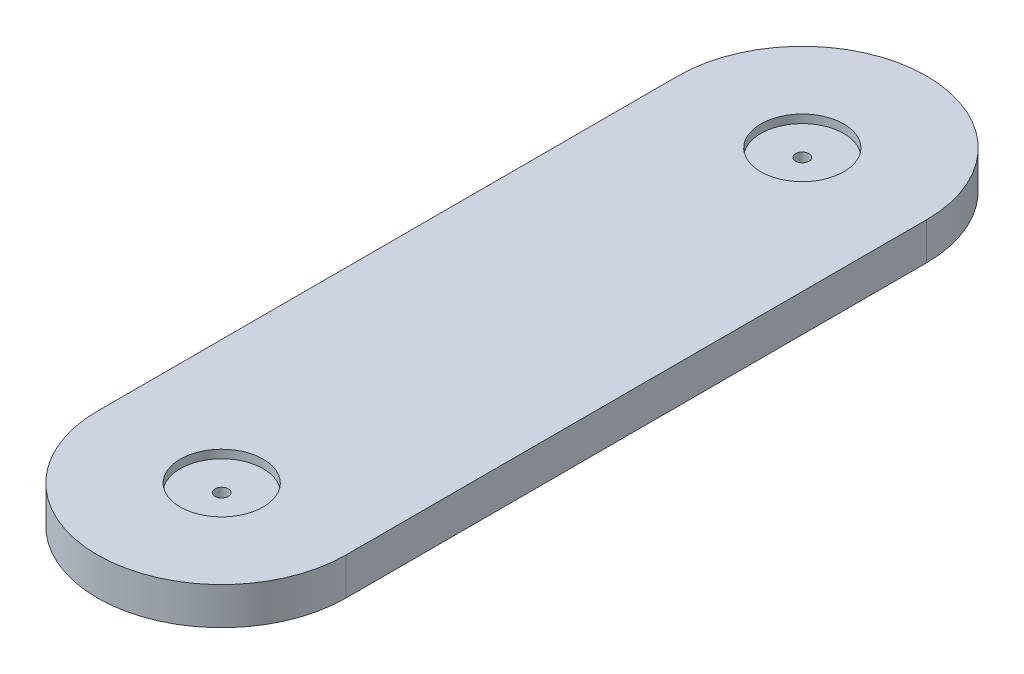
ISO-10303-21;
HEADER;
FILE_DESCRIPTION(('STEP AP214'),'2;1');
FILE_NAME('part.step','',(''),(''),'','','');
FILE_SCHEMA(('AUTOMOTIVE_DESIGN { 1 0 10303 214 1 1 1 1 }'));
ENDSEC;
DATA;
#1=APPLICATION_CONTEXT('core data for automotive mechanical design processes');
#2=APPLICATION_PROTOCOL_DEFINITION('international standard','automotive_design',2000,#1);
#3=PRODUCT_CONTEXT('',#1,'mechanical');
#4=PRODUCT('Part','Part','',(#3));
#5=PRODUCT_RELATED_PRODUCT_CATEGORY('part','',(#4));
#6=PRODUCT_DEFINITION_FORMATION('','',#4);
#7=PRODUCT_DEFINITION_CONTEXT('part definition',#1,'design');
#8=PRODUCT_DEFINITION('design','',#6,#7);
#9=PRODUCT_DEFINITION_SHAPE('','',#8);
#10=(LENGTH_UNIT() NAMED_UNIT(*) SI_UNIT(.MILLI.,.METRE.));
#11=(NAMED_UNIT(*) PLANE_ANGLE_UNIT() SI_UNIT($,.RADIAN.));
#12=(NAMED_UNIT(*) SI_UNIT($,.STERADIAN.) SOLID_ANGLE_UNIT());
#13=UNCERTAINTY_MEASURE_WITH_UNIT(LENGTH_MEASURE(1.E-05),#10,'distance_accuracy_value','');
#14=(GEOMETRIC_REPRESENTATION_CONTEXT(3) GLOBAL_UNCERTAINTY_ASSIGNED_CONTEXT((#13)) GLOBAL_UNIT_ASSIGNED_CONTEXT((#10,
#11,#12)) REPRESENTATION_CONTEXT('',''));
#15=CARTESIAN_POINT('',(0.,0.,0.));
#16=DIRECTION('',(0.,0.,1.));
#17=DIRECTION('',(1.,0.,0.));
#18=AXIS2_PLACEMENT_3D('',#15,#16,#17);
#19=CARTESIAN_POINT('',(-285.,0.,120.));
#20=DIRECTION('',(0.,-1.,0.));
#21=DIRECTION('',(0.,0.,-1.));
#22=AXIS2_PLACEMENT_3D('',#19,#20,#21);
#23=CYLINDRICAL_SURFACE('',#22,1.59999999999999);
#24=CARTESIAN_POINT('',(-285.,2.4,120.));
#25=DIRECTION('',(0.,-1.,0.));
#26=DIRECTION('',(0.,0.,-1.));
#27=AXIS2_PLACEMENT_3D('',#24,#25,#26);
#28=CIRCLE('',#27,1.59999999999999);
#29=CARTESIAN_POINT('',(-285.,2.4,118.4));
#30=VERTEX_POINT('',#29);
#31=EDGE_CURVE('E102',#30,#30,#28,.T.);
#32=ORIENTED_EDGE('',*,*,#31,.T.);
#33=EDGE_LOOP('',(#32));
#34=FACE_BOUND('',#33,.T.);
#35=CARTESIAN_POINT('',(-285.,7.,120.));
#36=DIRECTION('',(0.,1.,0.));
#37=DIRECTION('',(0.,0.,1.));
#38=AXIS2_PLACEMENT_3D('',#35,#36,#37);
#39=CIRCLE('',#38,1.59999999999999);
#40=CARTESIAN_POINT('',(-285.,7.,121.6));
#41=VERTEX_POINT('',#40);
#42=EDGE_CURVE('E36',#41,#41,#39,.F.);
#43=ORIENTED_EDGE('',*,*,#42,.F.);
#44=EDGE_LOOP('',(#43));
#45=FACE_BOUND('',#44,.T.);
#46=ADVANCED_FACE('F32',(#34,#45),#23,.F.);
#47=CARTESIAN_POINT('',(-285.,0.,-20.));
#48=DIRECTION('',(0.,-1.,0.));
#49=DIRECTION('',(0.,0.,-1.));
#50=AXIS2_PLACEMENT_3D('',#47,#48,#49);
#51=CYLINDRICAL_SURFACE('',#50,1.59999999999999);
#52=CARTESIAN_POINT('',(-285.,2.4,-20.));
#53=DIRECTION('',(0.,-1.,0.));
#54=DIRECTION('',(0.,0.,-1.));
#55=AXIS2_PLACEMENT_3D('',#52,#53,#54);
#56=CIRCLE('',#55,1.59999999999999);
#57=CARTESIAN_POINT('',(-285.,2.4,-21.6));
#58=VERTEX_POINT('',#57);
#59=EDGE_CURVE('E133',#58,#58,#56,.T.);
#60=ORIENTED_EDGE('',*,*,#59,.T.);
#61=EDGE_LOOP('',(#60));
#62=FACE_BOUND('',#61,.T.);
#63=CARTESIAN_POINT('',(-285.,7.,-20.));
#64=DIRECTION('',(0.,1.,0.));
#65=DIRECTION('',(0.,0.,1.));
#66=AXIS2_PLACEMENT_3D('',#63,#64,#65);
#67=CIRCLE('',#66,1.59999999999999);
#68=CARTESIAN_POINT('',(-285.,7.,-18.4));
#69=VERTEX_POINT('',#68);
#70=EDGE_CURVE('E107',#69,#69,#67,.F.);
#71=ORIENTED_EDGE('',*,*,#70,.F.);
#72=EDGE_LOOP('',(#71));
#73=FACE_BOUND('',#72,.T.);
#74=ADVANCED_FACE('F178',(#62,#73),#51,.F.);
#75=CARTESIAN_POINT('',(-285.,9.,-20.));
#76=DIRECTION('',(0.,-1.,0.));
#77=DIRECTION('',(0.,0.,-1.));
#78=AXIS2_PLACEMENT_3D('',#75,#76,#77);
#79=CYLINDRICAL_SURFACE('',#78,30.);
#80=CARTESIAN_POINT('',(-285.,0.,-20.));
#81=DIRECTION('',(0.,1.,0.));
#82=DIRECTION('',(0.,0.,1.));
#83=AXIS2_PLACEMENT_3D('',#80,#81,#82);
#84=CIRCLE('',#83,30.);
#85=CARTESIAN_POINT('',(-255.,0.,-20.));
#86=VERTEX_POINT('',#85);
#87=CARTESIAN_POINT('',(-315.,0.,-20.));
#88=VERTEX_POINT('',#87);
#89=EDGE_CURVE('E99',#86,#88,#84,.T.);
#90=ORIENTED_EDGE('',*,*,#89,.T.);
#91=DIRECTION('',(0.,-1.,0.));
#92=VECTOR('',#91,1.);
#93=CARTESIAN_POINT('',(-315.,9.,-20.));
#94=LINE('',#93,#92);
#95=CARTESIAN_POINT('',(-315.,9.,-20.));
#96=VERTEX_POINT('',#95);
#97=EDGE_CURVE('E11',#96,#88,#94,.T.);
#98=ORIENTED_EDGE('',*,*,#97,.F.);
#99=CARTESIAN_POINT('',(-285.,9.,-20.));
#100=DIRECTION('',(0.,1.,0.));
#101=DIRECTION('',(0.,0.,1.));
#102=AXIS2_PLACEMENT_3D('',#99,#100,#101);
#103=CIRCLE('',#102,30.);
#104=CARTESIAN_POINT('',(-255.,9.,-20.));
#105=VERTEX_POINT('',#104);
#106=EDGE_CURVE('E86',#105,#96,#103,.T.);
#107=ORIENTED_EDGE('',*,*,#106,.F.);
#108=DIRECTION('',(0.,-1.,0.));
#109=VECTOR('',#108,1.);
#110=CARTESIAN_POINT('',(-255.,9.,-20.));
#111=LINE('',#110,#109);
#112=EDGE_CURVE('E95',#105,#86,#111,.T.);
#113=ORIENTED_EDGE('',*,*,#112,.T.);
#114=EDGE_LOOP('',(#90,#98,#107,#113));
#115=FACE_BOUND('',#114,.T.);
#116=ADVANCED_FACE('F34',(#115),#79,.T.);
#117=CARTESIAN_POINT('',(-315.,9.,-20.));
#118=DIRECTION('',(1.,0.,0.));
#119=DIRECTION('',(0.,0.,-1.));
#120=AXIS2_PLACEMENT_3D('',#117,#118,#119);
#121=PLANE('',#120);
#122=DIRECTION('',(0.,0.,1.));
#123=VECTOR('',#122,1.);
#124=CARTESIAN_POINT('',(-315.,0.,-20.));
#125=LINE('',#124,#123);
#126=CARTESIAN_POINT('',(-315.,0.,120.));
#127=VERTEX_POINT('',#126);
#128=EDGE_CURVE('E90',#88,#127,#125,.T.);
#129=ORIENTED_EDGE('',*,*,#128,.T.);
#130=DIRECTION('',(0.,-1.,0.));
#131=VECTOR('',#130,1.);
#132=CARTESIAN_POINT('',(-315.,9.,120.));
#133=LINE('',#132,#131);
#134=CARTESIAN_POINT('',(-315.,9.,120.));
#135=VERTEX_POINT('',#134);
#136=EDGE_CURVE('E42',#135,#127,#133,.T.);
#137=ORIENTED_EDGE('',*,*,#136,.F.);
#138=DIRECTION('',(0.,0.,1.));
#139=VECTOR('',#138,1.);
#140=CARTESIAN_POINT('',(-315.,9.,-20.));
#141=LINE('',#140,#139);
#142=EDGE_CURVE('E81',#96,#135,#141,.T.);
#143=ORIENTED_EDGE('',*,*,#142,.F.);
#144=ORIENTED_EDGE('',*,*,#97,.T.);
#145=EDGE_LOOP('',(#129,#137,#143,#144));
#146=FACE_BOUND('',#145,.T.);
#147=ADVANCED_FACE('F89',(#146),#121,.F.);
#148=CARTESIAN_POINT('',(-285.,9.,120.));
#149=DIRECTION('',(0.,-1.,0.));
#150=DIRECTION('',(0.,0.,-1.));
#151=AXIS2_PLACEMENT_3D('',#148,#149,#150);
#152=CYLINDRICAL_SURFACE('',#151,29.9999999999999);
#153=CARTESIAN_POINT('',(-285.,0.,120.));
#154=DIRECTION('',(0.,1.,0.));
#155=DIRECTION('',(0.,0.,1.));
#156=AXIS2_PLACEMENT_3D('',#153,#154,#155);
#157=CIRCLE('',#156,29.9999999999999);
#158=CARTESIAN_POINT('',(-255.,0.,120.));
#159=VERTEX_POINT('',#158);
#160=EDGE_CURVE('E68',#127,#159,#157,.T.);
#161=ORIENTED_EDGE('',*,*,#160,.T.);
#162=DIRECTION('',(0.,-1.,0.));
#163=VECTOR('',#162,1.);
#164=CARTESIAN_POINT('',(-255.,9.,120.));
#165=LINE('',#164,#163);
#166=CARTESIAN_POINT('',(-255.,9.,120.));
#167=VERTEX_POINT('',#166);
#168=EDGE_CURVE('E91',#167,#159,#165,.T.);
#169=ORIENTED_EDGE('',*,*,#168,.F.);
#170=CARTESIAN_POINT('',(-285.,9.,120.));
#171=DIRECTION('',(0.,1.,0.));
#172=DIRECTION('',(0.,0.,1.));
#173=AXIS2_PLACEMENT_3D('',#170,#171,#172);
#174=CIRCLE('',#173,29.9999999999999);
#175=EDGE_CURVE('E84',#135,#167,#174,.T.);
#176=ORIENTED_EDGE('',*,*,#175,.F.);
#177=ORIENTED_EDGE('',*,*,#136,.T.);
#178=EDGE_LOOP('',(#161,#169,#176,#177));
#179=FACE_BOUND('',#178,.T.);
#180=ADVANCED_FACE('F93',(#179),#152,.T.);
#181=CARTESIAN_POINT('',(-255.,9.,-20.));
#182=DIRECTION('',(-1.,0.,0.));
#183=DIRECTION('',(0.,0.,1.));
#184=AXIS2_PLACEMENT_3D('',#181,#182,#183);
#185=PLANE('',#184);
#186=DIRECTION('',(0.,0.,-1.));
#187=VECTOR('',#186,1.);
#188=CARTESIAN_POINT('',(-255.,0.,-20.));
#189=LINE('',#188,#187);
#190=EDGE_CURVE('E74',#159,#86,#189,.T.);
#191=ORIENTED_EDGE('',*,*,#190,.T.);
#192=ORIENTED_EDGE('',*,*,#112,.F.);
#193=DIRECTION('',(0.,0.,-1.));
#194=VECTOR('',#193,1.);
#195=CARTESIAN_POINT('',(-255.,9.,-20.));
#196=LINE('',#195,#194);
#197=EDGE_CURVE('E51',#167,#105,#196,.T.);
#198=ORIENTED_EDGE('',*,*,#197,.F.);
#199=ORIENTED_EDGE('',*,*,#168,.T.);
#200=EDGE_LOOP('',(#191,#192,#198,#199));
#201=FACE_BOUND('',#200,.T.);
#202=ADVANCED_FACE('F167',(#201),#185,.F.);
#203=CARTESIAN_POINT('',(-285.,9.,-20.));
#204=DIRECTION('',(0.,1.,0.));
#205=DIRECTION('',(0.,0.,1.));
#206=AXIS2_PLACEMENT_3D('',#203,#204,#205);
#207=PLANE('',#206);
#208=CARTESIAN_POINT('',(-285.,9.,-20.));
#209=DIRECTION('',(0.,1.,0.));
#210=DIRECTION('',(0.,0.,1.));
#211=AXIS2_PLACEMENT_3D('',#208,#209,#210);
#212=CIRCLE('',#211,9.99999999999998);
#213=CARTESIAN_POINT('',(-285.,9.,-10.));
#214=VERTEX_POINT('',#213);
#215=EDGE_CURVE('E115',#214,#214,#212,.T.);
#216=ORIENTED_EDGE('',*,*,#215,.F.);
#217=EDGE_LOOP('',(#216));
#218=FACE_BOUND('',#217,.T.);
#219=CARTESIAN_POINT('',(-285.,9.,120.));
#220=DIRECTION('',(0.,1.,0.));
#221=DIRECTION('',(0.,0.,1.));
#222=AXIS2_PLACEMENT_3D('',#219,#220,#221);
#223=CIRCLE('',#222,9.99999999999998);
#224=CARTESIAN_POINT('',(-285.,9.,130.));
#225=VERTEX_POINT('',#224);
#226=EDGE_CURVE('E125',#225,#225,#223,.T.);
#227=ORIENTED_EDGE('',*,*,#226,.F.);
#228=EDGE_LOOP('',(#227));
#229=FACE_BOUND('',#228,.T.);
#230=ORIENTED_EDGE('',*,*,#106,.T.);
#231=ORIENTED_EDGE('',*,*,#142,.T.);
#232=ORIENTED_EDGE('',*,*,#175,.T.);
#233=ORIENTED_EDGE('',*,*,#197,.T.);
#234=EDGE_LOOP('',(#230,#231,#232,#233));
#235=FACE_BOUND('',#234,.T.);
#236=ADVANCED_FACE('F82',(#218,#229,#235),#207,.T.);
#237=CARTESIAN_POINT('',(-285.,0.,-20.));
#238=DIRECTION('',(0.,1.,0.));
#239=DIRECTION('',(0.,0.,1.));
#240=AXIS2_PLACEMENT_3D('',#237,#238,#239);
#241=PLANE('',#240);
#242=CARTESIAN_POINT('',(-285.,0.,-20.));
#243=DIRECTION('',(0.,-1.,0.));
#244=DIRECTION('',(0.,0.,-1.));
#245=AXIS2_PLACEMENT_3D('',#242,#243,#244);
#246=CIRCLE('',#245,3.5);
#247=CARTESIAN_POINT('',(-285.,0.,-23.5));
#248=VERTEX_POINT('',#247);
#249=EDGE_CURVE('E113',#248,#248,#246,.T.);
#250=ORIENTED_EDGE('',*,*,#249,.F.);
#251=EDGE_LOOP('',(#250));
#252=FACE_BOUND('',#251,.T.);
#253=CARTESIAN_POINT('',(-285.,0.,120.));
#254=DIRECTION('',(0.,-1.,0.));
#255=DIRECTION('',(0.,0.,-1.));
#256=AXIS2_PLACEMENT_3D('',#253,#254,#255);
#257=CIRCLE('',#256,3.5);
#258=CARTESIAN_POINT('',(-285.,0.,116.5));
#259=VERTEX_POINT('',#258);
#260=EDGE_CURVE('E136',#259,#259,#257,.T.);
#261=ORIENTED_EDGE('',*,*,#260,.F.);
#262=EDGE_LOOP('',(#261));
#263=FACE_BOUND('',#262,.T.);
#264=ORIENTED_EDGE('',*,*,#89,.F.);
#265=ORIENTED_EDGE('',*,*,#190,.F.);
#266=ORIENTED_EDGE('',*,*,#160,.F.);
#267=ORIENTED_EDGE('',*,*,#128,.F.);
#268=EDGE_LOOP('',(#264,#265,#266,#267));
#269=FACE_BOUND('',#268,.T.);
#270=ADVANCED_FACE('F151',(#252,#263,#269),#241,.F.);
#271=CARTESIAN_POINT('',(-283.4,2.4,120.));
#272=DIRECTION('',(0.,1.,0.));
#273=DIRECTION('',(0.,0.,1.));
#274=AXIS2_PLACEMENT_3D('',#271,#272,#273);
#275=PLANE('',#274);
#276=ORIENTED_EDGE('',*,*,#31,.F.);
#277=EDGE_LOOP('',(#276));
#278=FACE_BOUND('',#277,.T.);
#279=CARTESIAN_POINT('',(-285.,2.4,120.));
#280=DIRECTION('',(0.,-1.,0.));
#281=DIRECTION('',(0.,0.,-1.));
#282=AXIS2_PLACEMENT_3D('',#279,#280,#281);
#283=CIRCLE('',#282,3.5);
#284=CARTESIAN_POINT('',(-285.,2.4,116.5));
#285=VERTEX_POINT('',#284);
#286=EDGE_CURVE('E139',#285,#285,#283,.T.);
#287=ORIENTED_EDGE('',*,*,#286,.T.);
#288=EDGE_LOOP('',(#287));
#289=FACE_BOUND('',#288,.T.);
#290=ADVANCED_FACE('F147',(#278,#289),#275,.F.);
#291=CARTESIAN_POINT('',(-285.,0.,120.));
#292=DIRECTION('',(0.,-1.,0.));
#293=DIRECTION('',(0.,0.,-1.));
#294=AXIS2_PLACEMENT_3D('',#291,#292,#293);
#295=CYLINDRICAL_SURFACE('',#294,3.5);
#296=ORIENTED_EDGE('',*,*,#286,.F.);
#297=EDGE_LOOP('',(#296));
#298=FACE_BOUND('',#297,.T.);
#299=ORIENTED_EDGE('',*,*,#260,.T.);
#300=EDGE_LOOP('',(#299));
#301=FACE_BOUND('',#300,.T.);
#302=ADVANCED_FACE('F150',(#298,#301),#295,.F.);
#303=CARTESIAN_POINT('',(-283.4,2.4,-20.));
#304=DIRECTION('',(0.,1.,0.));
#305=DIRECTION('',(0.,0.,1.));
#306=AXIS2_PLACEMENT_3D('',#303,#304,#305);
#307=PLANE('',#306);
#308=ORIENTED_EDGE('',*,*,#59,.F.);
#309=EDGE_LOOP('',(#308));
#310=FACE_BOUND('',#309,.T.);
#311=CARTESIAN_POINT('',(-285.,2.4,-20.));
#312=DIRECTION('',(0.,-1.,0.));
#313=DIRECTION('',(0.,0.,-1.));
#314=AXIS2_PLACEMENT_3D('',#311,#312,#313);
#315=CIRCLE('',#314,3.5);
#316=CARTESIAN_POINT('',(-285.,2.4,-23.5));
#317=VERTEX_POINT('',#316);
#318=EDGE_CURVE('E130',#317,#317,#315,.T.);
#319=ORIENTED_EDGE('',*,*,#318,.T.);
#320=EDGE_LOOP('',(#319));
#321=FACE_BOUND('',#320,.T.);
#322=ADVANCED_FACE('F157',(#310,#321),#307,.F.);
#323=CARTESIAN_POINT('',(-285.,0.,-20.));
#324=DIRECTION('',(0.,-1.,0.));
#325=DIRECTION('',(0.,0.,-1.));
#326=AXIS2_PLACEMENT_3D('',#323,#324,#325);
#327=CYLINDRICAL_SURFACE('',#326,3.5);
#328=ORIENTED_EDGE('',*,*,#318,.F.);
#329=EDGE_LOOP('',(#328));
#330=FACE_BOUND('',#329,.T.);
#331=ORIENTED_EDGE('',*,*,#249,.T.);
#332=EDGE_LOOP('',(#331));
#333=FACE_BOUND('',#332,.T.);
#334=ADVANCED_FACE('F188',(#330,#333),#327,.F.);
#335=CARTESIAN_POINT('',(-285.,7.,-20.));
#336=DIRECTION('',(0.,1.,0.));
#337=DIRECTION('',(0.,0.,1.));
#338=AXIS2_PLACEMENT_3D('',#335,#336,#337);
#339=PLANE('',#338);
#340=CARTESIAN_POINT('',(-285.,7.,-20.));
#341=DIRECTION('',(0.,1.,0.));
#342=DIRECTION('',(0.,0.,1.));
#343=AXIS2_PLACEMENT_3D('',#340,#341,#342);
#344=CIRCLE('',#343,9.99999999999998);
#345=CARTESIAN_POINT('',(-285.,7.,-10.));
#346=VERTEX_POINT('',#345);
#347=EDGE_CURVE('E109',#346,#346,#344,.T.);
#348=ORIENTED_EDGE('',*,*,#347,.T.);
#349=EDGE_LOOP('',(#348));
#350=FACE_BOUND('',#349,.T.);
#351=ORIENTED_EDGE('',*,*,#70,.T.);
#352=EDGE_LOOP('',(#351));
#353=FACE_BOUND('',#352,.T.);
#354=ADVANCED_FACE('F192',(#350,#353),#339,.T.);
#355=CARTESIAN_POINT('',(-285.,7.,-20.));
#356=DIRECTION('',(0.,1.,0.));
#357=DIRECTION('',(0.,0.,1.));
#358=AXIS2_PLACEMENT_3D('',#355,#356,#357);
#359=CYLINDRICAL_SURFACE('',#358,9.99999999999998);
#360=ORIENTED_EDGE('',*,*,#347,.F.);
#361=EDGE_LOOP('',(#360));
#362=FACE_BOUND('',#361,.T.);
#363=ORIENTED_EDGE('',*,*,#215,.T.);
#364=EDGE_LOOP('',(#363));
#365=FACE_BOUND('',#364,.T.);
#366=ADVANCED_FACE('F201',(#362,#365),#359,.F.);
#367=CARTESIAN_POINT('',(-285.,7.,120.));
#368=DIRECTION('',(0.,1.,0.));
#369=DIRECTION('',(0.,0.,1.));
#370=AXIS2_PLACEMENT_3D('',#367,#368,#369);
#371=PLANE('',#370);
#372=CARTESIAN_POINT('',(-285.,7.,120.));
#373=DIRECTION('',(0.,1.,0.));
#374=DIRECTION('',(0.,0.,1.));
#375=AXIS2_PLACEMENT_3D('',#372,#373,#374);
#376=CIRCLE('',#375,9.99999999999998);
#377=CARTESIAN_POINT('',(-285.,7.,130.));
#378=VERTEX_POINT('',#377);
#379=EDGE_CURVE('E120',#378,#378,#376,.T.);
#380=ORIENTED_EDGE('',*,*,#379,.T.);
#381=EDGE_LOOP('',(#380));
#382=FACE_BOUND('',#381,.T.);
#383=ORIENTED_EDGE('',*,*,#42,.T.);
#384=EDGE_LOOP('',(#383));
#385=FACE_BOUND('',#384,.T.);
#386=ADVANCED_FACE('F197',(#382,#385),#371,.T.);
#387=CARTESIAN_POINT('',(-285.,7.,120.));
#388=DIRECTION('',(0.,1.,0.));
#389=DIRECTION('',(0.,0.,1.));
#390=AXIS2_PLACEMENT_3D('',#387,#388,#389);
#391=CYLINDRICAL_SURFACE('',#390,9.99999999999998);
#392=ORIENTED_EDGE('',*,*,#379,.F.);
#393=EDGE_LOOP('',(#392));
#394=FACE_BOUND('',#393,.T.);
#395=ORIENTED_EDGE('',*,*,#226,.T.);
#396=EDGE_LOOP('',(#395));
#397=FACE_BOUND('',#396,.T.);
#398=ADVANCED_FACE('F194',(#394,#397),#391,.F.);
#399=CLOSED_SHELL('',(#46,#74,#116,#147,#180,#202,#236,#270,#290,#302,#322,#334,#354,#366,#386,#398));
#400=MANIFOLD_SOLID_BREP('B2',#399);
#401=ADVANCED_BREP_SHAPE_REPRESENTATION('',(#18,#400),#14);
#402=SHAPE_DEFINITION_REPRESENTATION(#9,#401);
ENDSEC;
END-ISO-10303-21;
